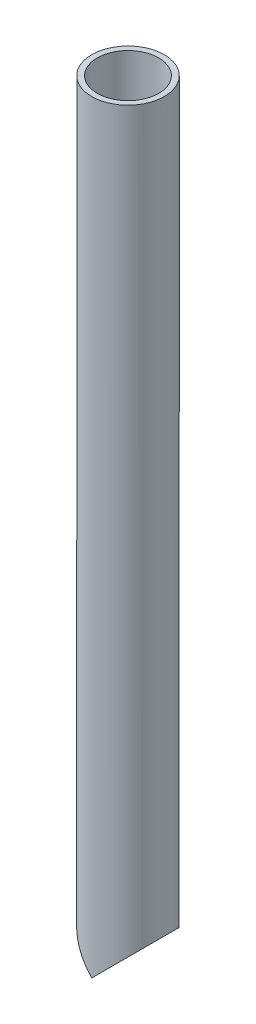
ISO-10303-21;
HEADER;
FILE_DESCRIPTION(('STEP AP214'),'2;1');
FILE_NAME('part.step','',(''),(''),'','','');
FILE_SCHEMA(('AUTOMOTIVE_DESIGN { 1 0 10303 214 1 1 1 1 }'));
ENDSEC;
DATA;
#1=APPLICATION_CONTEXT('core data for automotive mechanical design processes');
#2=APPLICATION_PROTOCOL_DEFINITION('international standard','automotive_design',2000,#1);
#3=PRODUCT_CONTEXT('',#1,'mechanical');
#4=PRODUCT('Part','Part','',(#3));
#5=PRODUCT_RELATED_PRODUCT_CATEGORY('part','',(#4));
#6=PRODUCT_DEFINITION_FORMATION('','',#4);
#7=PRODUCT_DEFINITION_CONTEXT('part definition',#1,'design');
#8=PRODUCT_DEFINITION('design','',#6,#7);
#9=PRODUCT_DEFINITION_SHAPE('','',#8);
#10=(LENGTH_UNIT() NAMED_UNIT(*) SI_UNIT(.MILLI.,.METRE.));
#11=(NAMED_UNIT(*) PLANE_ANGLE_UNIT() SI_UNIT($,.RADIAN.));
#12=(NAMED_UNIT(*) SI_UNIT($,.STERADIAN.) SOLID_ANGLE_UNIT());
#13=UNCERTAINTY_MEASURE_WITH_UNIT(LENGTH_MEASURE(1.E-05),#10,'distance_accuracy_value','');
#14=(GEOMETRIC_REPRESENTATION_CONTEXT(3) GLOBAL_UNCERTAINTY_ASSIGNED_CONTEXT((#13)) GLOBAL_UNIT_ASSIGNED_CONTEXT((#10,
#11,#12)) REPRESENTATION_CONTEXT('',''));
#15=CARTESIAN_POINT('',(0.,0.,0.));
#16=DIRECTION('',(0.,0.,1.));
#17=DIRECTION('',(1.,0.,0.));
#18=AXIS2_PLACEMENT_3D('',#15,#16,#17);
#19=CARTESIAN_POINT('',(0.,508.,0.));
#20=DIRECTION('',(0.,1.,0.));
#21=DIRECTION('',(0.,0.,1.));
#22=AXIS2_PLACEMENT_3D('',#19,#20,#21);
#23=PLANE('',#22);
#24=CARTESIAN_POINT('',(0.,508.,0.));
#25=DIRECTION('',(0.,1.,0.));
#26=DIRECTION('',(0.,0.,1.));
#27=AXIS2_PLACEMENT_3D('',#24,#25,#26);
#28=CIRCLE('',#27,24.13);
#29=CARTESIAN_POINT('',(0.,508.,24.13));
#30=VERTEX_POINT('',#29);
#31=EDGE_CURVE('E11',#30,#30,#28,.T.);
#32=ORIENTED_EDGE('',*,*,#31,.T.);
#33=EDGE_LOOP('',(#32));
#34=FACE_BOUND('',#33,.T.);
#35=CARTESIAN_POINT('',(0.,508.,0.));
#36=DIRECTION('',(0.,1.,0.));
#37=DIRECTION('',(0.,0.,1.));
#38=AXIS2_PLACEMENT_3D('',#35,#36,#37);
#39=CIRCLE('',#38,20.447);
#40=CARTESIAN_POINT('',(0.,508.,20.447));
#41=VERTEX_POINT('',#40);
#42=EDGE_CURVE('E44',#41,#41,#39,.T.);
#43=ORIENTED_EDGE('',*,*,#42,.F.);
#44=EDGE_LOOP('',(#43));
#45=FACE_BOUND('',#44,.T.);
#46=ADVANCED_FACE('F31',(#34,#45),#23,.T.);
#47=CARTESIAN_POINT('',(0.,508.,0.));
#48=DIRECTION('',(0.,-1.,0.));
#49=DIRECTION('',(0.,0.,-1.));
#50=AXIS2_PLACEMENT_3D('',#47,#48,#49);
#51=CYLINDRICAL_SURFACE('',#50,24.13);
#52=ORIENTED_EDGE('',*,*,#31,.F.);
#53=EDGE_LOOP('',(#52));
#54=FACE_BOUND('',#53,.T.);
#55=CARTESIAN_POINT('',(0.,0.,0.));
#56=DIRECTION('',(-0.707106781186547,-0.707106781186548,0.));
#57=DIRECTION('',(0.707106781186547,-0.707106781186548,0.));
#58=AXIS2_PLACEMENT_3D('',#55,#56,#57);
#59=ELLIPSE('',#58,34.1249732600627,24.13);
#60=CARTESIAN_POINT('',(0.,0.,-24.13));
#61=VERTEX_POINT('',#60);
#62=CARTESIAN_POINT('',(0.,0.,24.13));
#63=VERTEX_POINT('',#62);
#64=EDGE_CURVE('E52',#61,#63,#59,.F.);
#65=ORIENTED_EDGE('',*,*,#64,.T.);
#66=CARTESIAN_POINT('',(0.,0.,0.));
#67=DIRECTION('',(0.707106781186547,-0.707106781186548,0.));
#68=DIRECTION('',(-0.707106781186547,-0.707106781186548,0.));
#69=AXIS2_PLACEMENT_3D('',#66,#67,#68);
#70=ELLIPSE('',#69,34.1249732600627,24.13);
#71=EDGE_CURVE('E50',#63,#61,#70,.F.);
#72=ORIENTED_EDGE('',*,*,#71,.T.);
#73=EDGE_LOOP('',(#65,#72));
#74=FACE_BOUND('',#73,.T.);
#75=ADVANCED_FACE('F33',(#54,#74),#51,.T.);
#76=CARTESIAN_POINT('',(0.,508.,0.));
#77=DIRECTION('',(0.,-1.,0.));
#78=DIRECTION('',(0.,0.,-1.));
#79=AXIS2_PLACEMENT_3D('',#76,#77,#78);
#80=CYLINDRICAL_SURFACE('',#79,20.447);
#81=CARTESIAN_POINT('',(0.,12.8131608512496,-20.447));
#82=CARTESIAN_POINT('',(-0.350850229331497,12.8131706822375,-20.4469964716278));
#83=CARTESIAN_POINT('',(-0.701841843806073,12.8276511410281,-20.4379417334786));
#84=CARTESIAN_POINT('',(-1.40074676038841,12.8847824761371,-20.4019695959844));
#85=CARTESIAN_POINT('',(-1.7486575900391,12.9274542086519,-20.375038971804));
#86=CARTESIAN_POINT('',(-2.43949963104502,13.0388513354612,-20.3039307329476));
#87=CARTESIAN_POINT('',(-2.78241316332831,13.1076530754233,-20.2597025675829));
#88=CARTESIAN_POINT('',(-3.46039886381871,13.2681135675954,-20.1549795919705));
#89=CARTESIAN_POINT('',(-3.79546770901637,13.3597818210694,-20.0944780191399));
#90=CARTESIAN_POINT('',(-4.35822312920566,13.5322678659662,-19.9785377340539));
#91=CARTESIAN_POINT('',(-4.58822997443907,13.6082145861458,-19.9269375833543));
#92=CARTESIAN_POINT('',(-5.04350417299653,13.768393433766,-19.816601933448));
#93=CARTESIAN_POINT('',(-5.26877290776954,13.8526231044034,-19.7578685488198));
#94=CARTESIAN_POINT('',(-5.93771490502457,14.1161362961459,-19.5713517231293));
#95=CARTESIAN_POINT('',(-6.37433235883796,14.3061833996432,-19.4332915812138));
#96=CARTESIAN_POINT('',(-7.22991410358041,14.7073287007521,-19.1315073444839));
#97=CARTESIAN_POINT('',(-7.64882857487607,14.9184813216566,-18.9677162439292));
#98=CARTESIAN_POINT('',(-8.46866669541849,15.3549726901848,-18.6161311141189));
#99=CARTESIAN_POINT('',(-8.86959145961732,15.5803105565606,-18.4283385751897));
#100=CARTESIAN_POINT('',(-9.84603879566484,16.1523002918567,-17.932228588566));
#101=CARTESIAN_POINT('',(-10.411223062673,16.5044613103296,-17.6098352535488));
#102=CARTESIAN_POINT('',(-11.5055983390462,17.2157911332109,-16.9151147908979));
#103=CARTESIAN_POINT('',(-12.0347724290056,17.5749631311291,-16.5427644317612));
#104=CARTESIAN_POINT('',(-13.0564444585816,18.2897483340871,-15.7488764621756));
#105=CARTESIAN_POINT('',(-13.5489761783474,18.645364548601,-15.3273850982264));
#106=CARTESIAN_POINT('',(-14.496069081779,19.344541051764,-14.4349177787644));
#107=CARTESIAN_POINT('',(-14.9506454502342,19.6881061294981,-13.9639617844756));
#108=CARTESIAN_POINT('',(-15.7238428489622,20.2822430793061,-13.0807374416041));
#109=CARTESIAN_POINT('',(-16.0504778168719,20.5367406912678,-12.6781064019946));
#110=CARTESIAN_POINT('',(-16.6763928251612,21.0295488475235,-11.8427250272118));
#111=CARTESIAN_POINT('',(-16.9756738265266,21.2678599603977,-11.4099757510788));
#112=CARTESIAN_POINT('',(-17.5437864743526,21.7240172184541,-10.5154911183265));
#113=CARTESIAN_POINT('',(-17.8126584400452,21.9418903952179,-10.0537954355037));
#114=CARTESIAN_POINT('',(-18.1909499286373,22.2504483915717,-9.34032306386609));
#115=CARTESIAN_POINT('',(-18.3128738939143,22.3502559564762,-9.09901951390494));
#116=CARTESIAN_POINT('',(-18.548021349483,22.5433289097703,-8.60955574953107));
#117=CARTESIAN_POINT('',(-18.6612425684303,22.6365925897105,-8.36139376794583));
#118=CARTESIAN_POINT('',(-18.9485093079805,22.8738482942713,-7.69652880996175));
#119=CARTESIAN_POINT('',(-19.1147510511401,23.0118151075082,-7.27423862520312));
#120=CARTESIAN_POINT('',(-19.4203662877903,23.266296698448,-6.41385721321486));
#121=CARTESIAN_POINT('',(-19.5597450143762,23.3828156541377,-5.97576908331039));
#122=CARTESIAN_POINT('',(-19.8097188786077,23.5923166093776,-5.08608198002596));
#123=CARTESIAN_POINT('',(-19.9203241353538,23.6853068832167,-4.63448781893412));
#124=CARTESIAN_POINT('',(-20.1110910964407,23.8459730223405,-3.72045266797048));
#125=CARTESIAN_POINT('',(-20.1912524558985,23.913648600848,-3.2580115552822));
#126=CARTESIAN_POINT('',(-20.3200599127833,24.022504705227,-2.32345873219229));
#127=CARTESIAN_POINT('',(-20.3685597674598,24.0635622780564,-1.85131239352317));
#128=CARTESIAN_POINT('',(-20.432567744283,24.1177657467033,-0.9031802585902));
#129=CARTESIAN_POINT('',(-20.4480757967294,24.130911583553,-0.427194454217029));
#130=CARTESIAN_POINT('',(-20.445808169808,24.128990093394,0.524611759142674));
#131=CARTESIAN_POINT('',(-20.4280343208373,24.113924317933,1.00043217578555));
#132=CARTESIAN_POINT('',(-20.3595400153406,24.0559270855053,1.94795988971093));
#133=CARTESIAN_POINT('',(-20.3088208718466,24.0129967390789,2.41966735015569));
#134=CARTESIAN_POINT('',(-20.1802487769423,23.9043604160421,3.32103431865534));
#135=CARTESIAN_POINT('',(-20.1046486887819,23.8405473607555,3.75124818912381));
#136=CARTESIAN_POINT('',(-19.927064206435,23.6909832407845,4.60226596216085));
#137=CARTESIAN_POINT('',(-19.825081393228,23.6052334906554,5.02307042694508));
#138=CARTESIAN_POINT('',(-19.5961035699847,23.4132542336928,5.85302317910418));
#139=CARTESIAN_POINT('',(-19.4691075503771,23.3070239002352,6.26217099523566));
#140=CARTESIAN_POINT('',(-19.1916436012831,23.0757535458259,7.06695337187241));
#141=CARTESIAN_POINT('',(-19.0411742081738,22.9507123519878,7.46258708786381));
#142=CARTESIAN_POINT('',(-18.7054233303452,22.6728992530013,8.27001430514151));
#143=CARTESIAN_POINT('',(-18.518317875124,22.5187077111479,8.68055968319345));
#144=CARTESIAN_POINT('',(-18.1206041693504,22.1928005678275,9.48282731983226));
#145=CARTESIAN_POINT('',(-17.9099952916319,22.0210844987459,9.87454907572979));
#146=CARTESIAN_POINT('',(-17.4670353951,21.6623524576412,10.6384939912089));
#147=CARTESIAN_POINT('',(-17.2346722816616,21.4753279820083,11.0107061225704));
#148=CARTESIAN_POINT('',(-16.7499861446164,21.0883345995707,11.7348918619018));
#149=CARTESIAN_POINT('',(-16.4976591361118,20.8883631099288,12.0868614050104));
#150=CARTESIAN_POINT('',(-15.8455610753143,20.3764615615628,12.9387328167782));
#151=CARTESIAN_POINT('',(-15.4344209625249,20.0579329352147,13.426033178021));
#152=CARTESIAN_POINT('',(-14.5748384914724,19.4042517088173,14.3546000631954));
#153=CARTESIAN_POINT('',(-14.1263790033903,19.0690915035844,14.7958452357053));
#154=CARTESIAN_POINT('',(-13.1939412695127,18.3889952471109,15.6330774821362));
#155=CARTESIAN_POINT('',(-12.7098962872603,18.0440416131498,16.0289757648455));
#156=CARTESIAN_POINT('',(-11.7083512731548,17.3531218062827,16.7745060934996));
#157=CARTESIAN_POINT('',(-11.190862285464,17.0071560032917,17.1241532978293));
#158=CARTESIAN_POINT('',(-10.2480483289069,16.4043049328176,17.6998930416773));
#159=CARTESIAN_POINT('',(-9.82975048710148,16.1456439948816,17.9356825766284));
#160=CARTESIAN_POINT('',(-8.97254111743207,15.6385428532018,18.3795079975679));
#161=CARTESIAN_POINT('',(-8.53362724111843,15.39010381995,18.5875407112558));
#162=CARTESIAN_POINT('',(-7.63528688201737,14.9107566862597,18.9742144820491));
#163=CARTESIAN_POINT('',(-7.17591245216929,14.6798077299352,19.1529252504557));
#164=CARTESIAN_POINT('',(-6.23468711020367,14.2434103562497,19.4796394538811));
#165=CARTESIAN_POINT('',(-5.7528493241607,14.037947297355,19.6276605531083));
#166=CARTESIAN_POINT('',(-4.94782715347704,13.7322618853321,19.8419482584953));
#167=CARTESIAN_POINT('',(-4.63144692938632,13.6211206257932,19.9182637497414));
#168=CARTESIAN_POINT('',(-3.98998772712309,13.416584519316,20.0566046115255));
#169=CARTESIAN_POINT('',(-3.66491191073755,13.3231833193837,20.1186350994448));
#170=CARTESIAN_POINT('',(-3.00754305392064,13.1575647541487,20.2273384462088));
#171=CARTESIAN_POINT('',(-2.67526601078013,13.0853047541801,20.2740422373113));
#172=CARTESIAN_POINT('',(-2.00448024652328,12.9648082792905,20.351309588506));
#173=CARTESIAN_POINT('',(-1.66597175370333,12.9165709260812,20.3818737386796));
#174=CARTESIAN_POINT('',(-0.981923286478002,12.8461871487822,20.4263104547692));
#175=CARTESIAN_POINT('',(-0.636347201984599,12.8242873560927,20.4400252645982));
#176=CARTESIAN_POINT('',(0.055686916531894,12.8086120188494,20.4498520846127));
#177=CARTESIAN_POINT('',(0.40214491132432,12.8148352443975,20.4459648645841));
#178=CARTESIAN_POINT('',(1.09310406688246,12.855071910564,20.4206898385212));
#179=CARTESIAN_POINT('',(1.43760307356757,12.8891115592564,20.3992855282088));
#180=CARTESIAN_POINT('',(2.12152724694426,12.9831858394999,20.3395390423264));
#181=CARTESIAN_POINT('',(2.4609515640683,13.0432247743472,20.3011940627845));
#182=CARTESIAN_POINT('',(3.2031248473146,13.2014962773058,20.1987137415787));
#183=CARTESIAN_POINT('',(3.60420914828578,13.3051008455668,20.1308541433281));
#184=CARTESIAN_POINT('',(4.39365324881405,13.5402743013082,19.9734278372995));
#185=CARTESIAN_POINT('',(4.78200919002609,13.6718515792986,19.8838546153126));
#186=CARTESIAN_POINT('',(5.54623302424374,13.9574978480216,19.6843984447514));
#187=CARTESIAN_POINT('',(5.9220615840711,14.111630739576,19.574457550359));
#188=CARTESIAN_POINT('',(6.66005566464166,14.4368900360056,19.3358182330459));
#189=CARTESIAN_POINT('',(7.02222057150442,14.6080172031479,19.2071189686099));
#190=CARTESIAN_POINT('',(7.95839171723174,15.0751178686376,18.844936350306));
#191=CARTESIAN_POINT('',(8.52147744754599,15.3815873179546,18.5966696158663));
#192=CARTESIAN_POINT('',(9.6149063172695,16.0132654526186,18.055626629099));
#193=CARTESIAN_POINT('',(10.145229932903,16.3384850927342,17.7628241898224));
#194=CARTESIAN_POINT('',(11.1751226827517,16.9971684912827,17.1336197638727));
#195=CARTESIAN_POINT('',(11.6746510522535,17.3306423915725,16.7971617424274));
#196=CARTESIAN_POINT('',(12.6423739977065,17.9967700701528,16.0814259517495));
#197=CARTESIAN_POINT('',(13.1105752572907,18.3294240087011,15.7021573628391));
#198=CARTESIAN_POINT('',(14.0325571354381,18.9996244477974,14.8849339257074));
#199=CARTESIAN_POINT('',(14.485053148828,19.3368516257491,14.4452614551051));
#200=CARTESIAN_POINT('',(15.3528727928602,19.9951987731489,13.5193127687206));
#201=CARTESIAN_POINT('',(15.7681893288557,20.3163156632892,13.0330276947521));
#202=CARTESIAN_POINT('',(16.5567309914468,20.9342459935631,12.0153009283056));
#203=CARTESIAN_POINT('',(16.9300640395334,21.2311211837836,11.4839814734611));
#204=CARTESIAN_POINT('',(17.4553003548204,21.6530322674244,10.6536165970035));
#205=CARTESIAN_POINT('',(17.6245612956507,21.7897492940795,10.3713111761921));
#206=CARTESIAN_POINT('',(17.9508816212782,22.0545263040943,9.79566919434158));
#207=CARTESIAN_POINT('',(18.1079381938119,22.1825842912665,9.50233011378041));
#208=CARTESIAN_POINT('',(18.4635494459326,22.4736704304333,8.79685495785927));
#209=CARTESIAN_POINT('',(18.6565332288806,22.6325670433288,8.38017010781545));
#210=CARTESIAN_POINT('',(19.0161266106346,22.9298918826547,7.5286304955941));
#211=CARTESIAN_POINT('',(19.1827433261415,23.0683256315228,7.09378067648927));
#212=CARTESIAN_POINT('',(19.4874573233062,23.3223284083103,6.20790409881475));
#213=CARTESIAN_POINT('',(19.6255681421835,23.4379082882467,5.75688513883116));
#214=CARTESIAN_POINT('',(19.8713236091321,23.6440715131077,4.84098153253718));
#215=CARTESIAN_POINT('',(19.9789674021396,23.7346541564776,4.376096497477));
#216=CARTESIAN_POINT('',(20.1625508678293,23.8893928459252,3.43272895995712));
#217=CARTESIAN_POINT('',(20.2382936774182,23.9533847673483,2.95418094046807));
#218=CARTESIAN_POINT('',(20.355729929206,24.0526889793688,1.9899553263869));
#219=CARTESIAN_POINT('',(20.3974234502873,24.0880013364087,1.50427774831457));
#220=CARTESIAN_POINT('',(20.4459454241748,24.1291029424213,0.530041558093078));
#221=CARTESIAN_POINT('',(20.4527817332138,24.1348988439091,0.0414836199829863));
#222=CARTESIAN_POINT('',(20.431470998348,24.1168419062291,-0.934296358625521));
#223=CARTESIAN_POINT('',(20.4033262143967,24.0929909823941,-1.42151848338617));
#224=CARTESIAN_POINT('',(20.3168070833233,24.0197683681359,-2.34570522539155));
#225=CARTESIAN_POINT('',(20.2614586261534,23.9729519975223,-2.7831623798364));
#226=CARTESIAN_POINT('',(20.1232732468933,23.8562747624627,-3.65055097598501));
#227=CARTESIAN_POINT('',(20.0404383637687,23.7864156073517,-4.0804829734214));
#228=CARTESIAN_POINT('',(19.8484719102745,23.6249071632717,-4.9302924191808));
#229=CARTESIAN_POINT('',(19.7393368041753,23.5332549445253,-5.35016850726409));
#230=CARTESIAN_POINT('',(19.4962228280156,23.3297102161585,-6.17762817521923));
#231=CARTESIAN_POINT('',(19.3622425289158,23.2178165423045,-6.58521104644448));
#232=CARTESIAN_POINT('',(19.0638605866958,22.9695599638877,-7.40601033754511));
#233=CARTESIAN_POINT('',(18.8982864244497,22.8322639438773,-7.81851710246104));
#234=CARTESIAN_POINT('',(18.543432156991,22.5394304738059,-8.62645008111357));
#235=CARTESIAN_POINT('',(18.3541519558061,22.3838929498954,-9.02187622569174));
#236=CARTESIAN_POINT('',(17.953721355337,22.0567419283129,-9.79454138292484));
#237=CARTESIAN_POINT('',(17.7425712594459,21.8851286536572,-10.1717806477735));
#238=CARTESIAN_POINT('',(17.3000882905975,21.5279609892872,-10.9073855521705));
#239=CARTESIAN_POINT('',(17.0687513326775,21.3424037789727,-11.2657473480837));
#240=CARTESIAN_POINT('',(16.4714037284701,20.867137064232,-12.1312382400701));
#241=CARTESIAN_POINT('',(16.0942232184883,20.570333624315,-12.6268221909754));
#242=CARTESIAN_POINT('',(15.3030538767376,19.9574022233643,-13.5748996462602));
#243=CARTESIAN_POINT('',(14.8890497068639,19.6412662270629,-14.0273750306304));
#244=CARTESIAN_POINT('',(14.025564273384,18.9950284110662,-14.8908604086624));
#245=CARTESIAN_POINT('',(13.5759434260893,18.6648742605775,-15.3016912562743));
#246=CARTESIAN_POINT('',(12.6446658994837,17.9988505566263,-16.0798141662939));
#247=CARTESIAN_POINT('',(12.1630152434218,17.66298208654,-16.4471143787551));
#248=CARTESIAN_POINT('',(11.1584329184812,16.9866679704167,-17.1449894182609));
#249=CARTESIAN_POINT('',(10.6348774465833,16.6462615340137,-17.4747039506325));
#250=CARTESIAN_POINT('',(9.55370801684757,15.9771556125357,-18.0884828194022));
#251=CARTESIAN_POINT('',(8.9960732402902,15.6484634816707,-18.3725188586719));
#252=CARTESIAN_POINT('',(8.13441729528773,15.1752756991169,-18.7619190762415));
#253=CARTESIAN_POINT('',(7.84371593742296,15.0211964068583,-18.8853608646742));
#254=CARTESIAN_POINT('',(7.25309764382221,14.7214017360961,-19.11997370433));
#255=CARTESIAN_POINT('',(6.95317984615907,14.5756871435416,-19.2311436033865));
#256=CARTESIAN_POINT('',(6.34434949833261,14.2952783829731,-19.4404861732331));
#257=CARTESIAN_POINT('',(6.03545055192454,14.16056861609,-19.5386773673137));
#258=CARTESIAN_POINT('',(5.40815688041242,13.9047928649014,-19.7215198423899));
#259=CARTESIAN_POINT('',(5.0897639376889,13.7837243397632,-19.8061736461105));
#260=CARTESIAN_POINT('',(4.44865184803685,13.5601911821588,-19.9598657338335));
#261=CARTESIAN_POINT('',(4.12607855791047,13.4574648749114,-20.0291278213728));
#262=CARTESIAN_POINT('',(3.47243357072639,13.2716531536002,-20.1527318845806));
#263=CARTESIAN_POINT('',(3.14136158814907,13.1885684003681,-20.2070733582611));
#264=CARTESIAN_POINT('',(2.47327098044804,13.0456165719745,-20.2996561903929));
#265=CARTESIAN_POINT('',(2.13627862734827,12.9856654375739,-20.3379558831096));
#266=CARTESIAN_POINT('',(1.45738073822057,12.8914045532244,-20.3978373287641));
#267=CARTESIAN_POINT('',(1.11547894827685,12.8570762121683,-20.4194312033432));
#268=CARTESIAN_POINT('',(0.644004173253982,12.8286902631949,-20.4372615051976));
#269=CARTESIAN_POINT('',(0.515318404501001,12.8228734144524,-20.4409109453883));
#270=CARTESIAN_POINT('',(0.257761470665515,12.8151065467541,-20.4457810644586));
#271=CARTESIAN_POINT('',(0.128890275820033,12.8131572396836,-20.4470012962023));
#272=CARTESIAN_POINT('',(0.,12.8131608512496,-20.447));
#273=B_SPLINE_CURVE_WITH_KNOTS('',3,(#81,#82,#83,#84,#85,#86,#87,#88,#89,#90,#91,#92,#93,#94,
#95,#96,#97,#98,#99,#100,#101,#102,#103,#104,#105,#106,#107,#108,#109,#110,#111,#112,#113,#114,
#115,#116,#117,#118,#119,#120,#121,#122,#123,#124,#125,#126,#127,#128,#129,#130,#131,#132,#133,
#134,#135,#136,#137,#138,#139,#140,#141,#142,#143,#144,#145,#146,#147,#148,#149,#150,#151,#152,
#153,#154,#155,#156,#157,#158,#159,#160,#161,#162,#163,#164,#165,#166,#167,#168,#169,#170,#171,
#172,#173,#174,#175,#176,#177,#178,#179,#180,#181,#182,#183,#184,#185,#186,#187,#188,#189,#190,
#191,#192,#193,#194,#195,#196,#197,#198,#199,#200,#201,#202,#203,#204,#205,#206,#207,#208,#209,
#210,#211,#212,#213,#214,#215,#216,#217,#218,#219,#220,#221,#222,#223,#224,#225,#226,#227,#228,
#229,#230,#231,#232,#233,#234,#235,#236,#237,#238,#239,#240,#241,#242,#243,#244,#245,#246,#247,
#248,#249,#250,#251,#252,#253,#254,#255,#256,#257,#258,#259,#260,#261,#262,#263,#264,#265,#266,
#267,#268,#269,#270,#271,#272),.UNSPECIFIED.,.T.,.F.,(4,2,2,2,2,2,2,2,2,2,2,2,2,2,2,2,2,2,2,2,2,
2,2,2,2,2,2,2,2,2,2,2,2,2,2,2,2,2,2,2,2,2,2,2,2,2,2,2,2,2,2,2,2,2,2,2,2,2,2,2,2,2,2,2,2,2,2,2,2,
2,2,2,2,2,2,2,2,2,2,2,2,2,2,2,2,2,2,2,2,2,2,2,2,2,2,4),(0.,1.05239330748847,2.10556605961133,
3.16183990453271,4.21855337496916,4.96123655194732,5.70370010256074,7.18923954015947,
8.6787136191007,10.168095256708,12.384736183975,14.6024115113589,16.8180163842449,
19.0327305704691,20.7638902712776,22.494989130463,24.2237651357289,25.0880933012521,
25.9526462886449,27.3741514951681,28.7953795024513,30.2161070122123,31.6368506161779,
33.0641109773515,34.4913743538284,35.9185592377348,37.345687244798,38.6685600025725,
39.991353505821,41.3142004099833,42.6371298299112,44.066141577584,45.495191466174,
46.9250406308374,48.3551759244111,50.4902694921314,52.6263485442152,54.7665411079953,
56.9060304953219,58.5412232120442,60.1766026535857,61.8080358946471,63.4385275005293,
64.4695293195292,65.5001612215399,66.5287001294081,67.5572014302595,68.5952606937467,
69.6332745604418,70.6722675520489,71.7114325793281,72.968746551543,74.2264381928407,
75.4877644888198,76.7491473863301,78.808476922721,80.8690220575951,82.9322386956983,
84.9950137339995,87.1386438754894,89.2826821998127,91.4210766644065,92.4899368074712,
93.5590425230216,95.0153404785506,96.4712446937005,97.9264559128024,99.3817079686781,
100.845813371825,102.30991538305,103.773687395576,105.237364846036,106.566113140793,
107.894762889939,109.223591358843,110.552496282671,111.946791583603,113.341092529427,
114.735374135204,116.129938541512,118.196647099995,120.264220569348,122.340341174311,
124.416072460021,126.532462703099,128.650159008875,129.704027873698,130.757995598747,
131.810442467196,132.862692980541,133.898463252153,134.934268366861,135.966273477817,
136.997529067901,137.384070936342,137.770683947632),.UNSPECIFIED.);
#274=CARTESIAN_POINT('',(0.,12.8131608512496,-20.447));
#275=VERTEX_POINT('',#274);
#276=EDGE_CURVE('E35',#275,#275,#273,.T.);
#277=ORIENTED_EDGE('',*,*,#276,.F.);
#278=EDGE_LOOP('',(#277));
#279=FACE_BOUND('',#278,.T.);
#280=ORIENTED_EDGE('',*,*,#42,.T.);
#281=EDGE_LOOP('',(#280));
#282=FACE_BOUND('',#281,.T.);
#283=ADVANCED_FACE('F61',(#279,#282),#80,.F.);
#284=CARTESIAN_POINT('',(-38.1,0.,0.));
#285=DIRECTION('',(1.,0.,0.));
#286=DIRECTION('',(0.,0.,-1.));
#287=AXIS2_PLACEMENT_3D('',#284,#285,#286);
#288=CYLINDRICAL_SURFACE('',#287,24.13);
#289=ORIENTED_EDGE('',*,*,#276,.T.);
#290=EDGE_LOOP('',(#289));
#291=FACE_BOUND('',#290,.T.);
#292=ORIENTED_EDGE('',*,*,#64,.F.);
#293=ORIENTED_EDGE('',*,*,#71,.F.);
#294=EDGE_LOOP('',(#292,#293));
#295=FACE_BOUND('',#294,.T.);
#296=ADVANCED_FACE('F53',(#291,#295),#288,.F.);
#297=CLOSED_SHELL('',(#46,#75,#283,#296));
#298=MANIFOLD_SOLID_BREP('B2',#297);
#299=ADVANCED_BREP_SHAPE_REPRESENTATION('',(#18,#298),#14);
#300=SHAPE_DEFINITION_REPRESENTATION(#9,#299);
ENDSEC;
END-ISO-10303-21;
